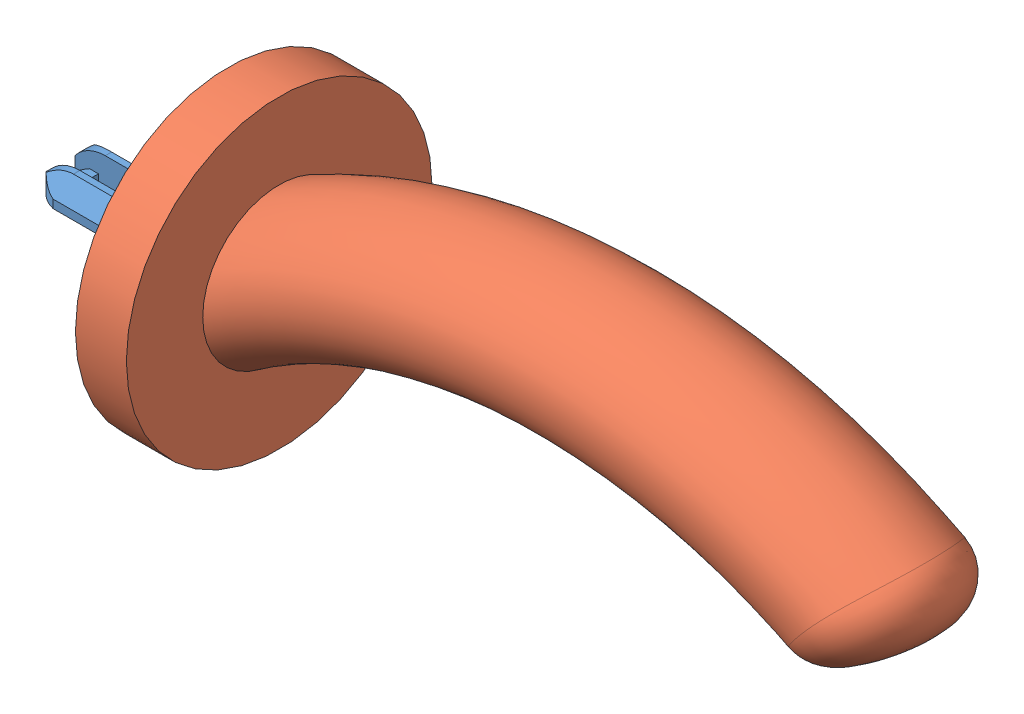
SolidWorks assembly Assem2.sldasm, configuration Default (file format 8000). Lengths in mm.
Overall size (141.93 48.52 48).
2 component instances, 2 part files, 2 mates.
Components (placement in the parent):
- connector_falcon-1: connector_falcon.SLDPRT [Default] at (-7.618 12.885 35.6964) size (30.65 10 10)
- curved grip-1: curved grip.SLDPRT [Default] at (22.382 17.385 30.1964) x (0 -1 0) z (0 0 -1) size (48.52 118.36 48)
Mates (geometry in assembly coordinates):
- Coincident2: coincident: line of connector_falcon-1 through (14.382 22.885 25.6964) axis (0 0 1); line of curved grip-1 through (14.382 22.885 -2.1285) axis (0 0 -1)
- Coincident5: coincident anti-aligned: line of connector_falcon-1 through (14.382 22.885 35.6964) axis (0 -1 0); line of curved grip-1 through (14.382 11.885 35.6964) axis (0 1 0)
